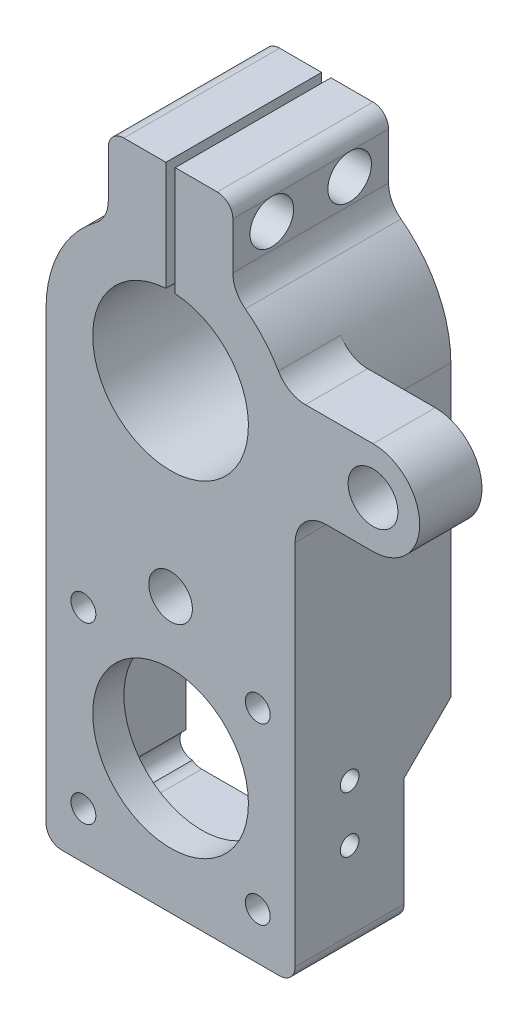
from build123d import *
from build123d.topology import SkipClean

# Parameters (mm, degrees)
SKETCH_1_R          = 25
SKETCH_1_R_2        = 8
SKETCH_1_R_3        = 4
SKETCH_1_R_4        = 7
EXTRUDE_1_DEPTH     = 20
FILLET_1_R          = 5
EXTRUDE_START       = 30
SKETCH_4_R          = 4
SKETCH_4_R_2        = 7
SKETCH_4_R_3        = 25
EXTRUDE_3_DEPTH     = 30
CUT_EXTRUDE_1_DEPTH = 40
CUT_EXTRUDE_2_DEPTH = 80
SKETCH_7_W          = 3
SKETCH_7_H          = 81.282537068
CUT_EXTRUDE_3_DEPTH = 41
SKETCH_8_R          = 7
CUT_EXTRUDE_4_DEPTH = 10
SKETCH_9_R          = 4.5
CUT_EXTRUDE_5_DEPTH = 182.727818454
SKETCH_10_R         = 3
CUT_EXTRUDE_6_DEPTH = 10
SKETCH_12_R         = 2.5
CUT_EXTRUDE_8_DEPTH = 15


with BuildPart() as part:
    # Sketch 1 → Extrude 1 (new body)
    with BuildSketch(Plane.XY):
        with BuildLine():
            Line((0, -43), (40, -43))
            Line((40, -43), (40, 80))
            ThreePointArc((40, 80), (42.928932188, 87.071067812), (50, 90))
            Line((50, 90), (65, 90))
            ThreePointArc((65, 90), (80, 105), (65, 120))
            Line((65, 120), (43.301270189, 120))
            ThreePointArc((43.301270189, 120), (38.301270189, 121.339745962), (34.641016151, 125))
            ThreePointArc((34.641016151, 125), (29.928117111, 131.53879813), (24, 137))
            ThreePointArc((24, 137), (21.05572809, 140.527864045), (20, 145))
            Line((20, 145), (20, 160))
            ThreePointArc((20, 160), (18.535533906, 163.535533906), (15, 165))
            Line((15, 165), (0, 165))
            Line((0, 165), (-15, 165))
            ThreePointArc((-15, 165), (-18.535533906, 163.535533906), (-20, 160))
            Line((-20, 160), (-20, 145))
            ThreePointArc((-20, 145), (-21.05572809, 140.527864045), (-24, 137))
            ThreePointArc((-24, 137), (-35.77708764, 122.88854382), (-40, 105))
            Line((-40, 105), (-40, -43))
            Line((-40, -43), (0, -43))
        make_face()
        Circle(SKETCH_1_R, mode=Mode.SUBTRACT)
        with Locations((0, 105)):
            Circle(SKETCH_1_R, mode=Mode.SUBTRACT)
        with Locations((65, 105)):
            Circle(SKETCH_1_R_2, mode=Mode.SUBTRACT)
        with Locations((28, 28)):
            Circle(SKETCH_1_R_3, mode=Mode.SUBTRACT)
        with Locations(Location((28, -28, 0), (0, 0, 180))):
            Circle(SKETCH_1_R_3, mode=Mode.SUBTRACT)
        with Locations((-28, -28)):
            Circle(SKETCH_1_R_3, mode=Mode.SUBTRACT)
        with Locations(Location((-28, 28, 0), (0, 0, 180))):
            Circle(SKETCH_1_R_3, mode=Mode.SUBTRACT)
        with Locations((0, 45)):
            Circle(SKETCH_1_R_4, mode=Mode.SUBTRACT)
    extrude(amount=EXTRUDE_1_DEPTH)

    # Fillet 1
    fillet_1_edges = [part.edges().sort_by_distance(p)[0] for p in [
        (-40, -43, 10),
        (40, -43, 10),
    ]]
    fillet(fillet_1_edges, radius=FILLET_1_R)

    # Sketch 4 → Extrude 3 (add)
    with SkipClean():  # the faces are left unmerged after this step: merging them gives an invalid solid
        with BuildSketch(Plane(origin=(0, 0, 0), x_dir=(-1, 0, 0), z_dir=(0, 0, -1)).offset(EXTRUDE_START)):
            with BuildLine():
                Line((-40, -38), (-40, 105))
                ThreePointArc((-40, 105), (-35.77708764, 122.88854382), (-24, 137))
                ThreePointArc((-24, 137), (-21.05572809, 140.527864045), (-20, 145))
                Line((-20, 145), (-20, 160))
                ThreePointArc((-20, 160), (-18.535533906, 163.535533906), (-15, 165))
                Line((-15, 165), (15, 165))
                ThreePointArc((15, 165), (18.535533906, 163.535533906), (20, 160))
                Line((20, 160), (20, 145))
                ThreePointArc((20, 145), (21.05572809, 140.527864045), (24, 137))
                ThreePointArc((24, 137), (35.77708764, 122.88854382), (40, 105))
                Line((40, 105), (40, -38))
                ThreePointArc((40, -38), (38.535533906, -41.535533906), (35, -43))
                Line((35, -43), (-35, -43))
                ThreePointArc((-35, -43), (-38.535533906, -41.535533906), (-40, -38))
            make_face()
            with Locations((28, -28)):
                Circle(SKETCH_4_R, mode=Mode.SUBTRACT)
            with Locations((-28, -28)):
                Circle(SKETCH_4_R, mode=Mode.SUBTRACT)
            with Locations((28, 28)):
                Circle(SKETCH_4_R, mode=Mode.SUBTRACT)
            with Locations((-28, 28)):
                Circle(SKETCH_4_R, mode=Mode.SUBTRACT)
            with Locations((0, 45)):
                Circle(SKETCH_4_R_2, mode=Mode.SUBTRACT)
            Circle(SKETCH_4_R_3, mode=Mode.SUBTRACT)
            with Locations((0, 105)):
                Circle(SKETCH_4_R_3, mode=Mode.SUBTRACT)
        extrude(amount=-EXTRUDE_3_DEPTH)

    # Sketch 5 → Cut-Extrude 1 (cut)
    with SkipClean():  # the faces are left unmerged after this step: merging them gives an invalid solid
        with BuildSketch(Plane(origin=(0, 0, -30), x_dir=(-1, 0, 0), z_dir=(0, 0, -1))):
            with BuildLine():
                Line((30, 59.17424305), (30, -28))
                ThreePointArc((30, -28), (28.535533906, -31.535533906), (25, -33))
                Line((25, -33), (-25, -33))
                ThreePointArc((-25, -33), (-28.535533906, -31.535533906), (-30, -28))
                Line((-30, -28), (-30, 59.17424305))
                ThreePointArc((-30, 59.17424305), (-25.477225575, 67.540843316), (-16, 68.33939444))
                ThreePointArc((-16, 68.33939444), (0, 65), (16, 68.33939444))
                ThreePointArc((16, 68.33939444), (25.477225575, 67.540843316), (30, 59.17424305))
            make_face()
        extrude(amount=-CUT_EXTRUDE_1_DEPTH, mode=Mode.SUBTRACT)

    # Sketch 6 → Cut-Extrude 2 (cut)
    with SkipClean():  # the faces are left unmerged after this step: merging them gives an invalid solid
        with BuildSketch(Plane(origin=(40, 0, 0), x_dir=(0, 0, -1), z_dir=(1, 0, 0))):
            Polygon((30, -43), (15, -43), (15, -3), (30, 12), align=None)
        extrude(amount=-CUT_EXTRUDE_2_DEPTH, mode=Mode.SUBTRACT)

    # Sketch 7 → Cut-Extrude 3 (cut)
    with SkipClean():  # the faces are left unmerged after this step: merging them gives an invalid solid
        with BuildSketch(Plane(origin=(0, 165, 0), x_dir=(1, 0, 0), z_dir=(0, 1, 0))):
            Rectangle(SKETCH_7_W, SKETCH_7_H)
        extrude(amount=-CUT_EXTRUDE_3_DEPTH, mode=Mode.SUBTRACT)

    # Sketch 8 → Cut-Extrude 4 (cut)
    with SkipClean():  # the faces are left unmerged after this step: merging them gives an invalid solid
        with BuildSketch(Plane(origin=(20, 0, 0), x_dir=(0, 0, -1), z_dir=(1, 0, 0))):
            with Locations(Location((-7.5, 153, 0), (0, 0, 90))):
                Circle(SKETCH_8_R)
            with Locations(Location((17.5, 153, 0), (0, 0, 90))):
                Circle(SKETCH_8_R)
        extrude(amount=-CUT_EXTRUDE_4_DEPTH, mode=Mode.SUBTRACT)

    # Sketch 9 → Cut-Extrude 5 (cut, through all)
    with SkipClean():  # the faces are left unmerged after this step: merging them gives an invalid solid
        with BuildSketch(Plane(origin=(10, 0, 0), x_dir=(0, 0, -1), z_dir=(1, 0, 0))):
            with Locations(Location((-7.5, 153, 0), (0, 0, 90))):
                Circle(SKETCH_9_R)
            with Locations(Location((17.5, 153, 0), (0, 0, 90))):
                Circle(SKETCH_9_R)
        extrude(amount=-CUT_EXTRUDE_5_DEPTH, mode=Mode.SUBTRACT)

    # Sketch 10 → Cut-Extrude 6 (cut)
    with SkipClean():  # the faces are left unmerged after this step: merging them gives an invalid solid
        with BuildSketch(Plane(origin=(40, 0, 0), x_dir=(0, 0, -1), z_dir=(1, 0, 0))):
            with Locations(Location((-2.5, -13, 0), (0, 0, 90))):
                Circle(SKETCH_10_R)
            with Locations(Location((-2.5, 5, 0), (0, 0, 90))):
                Circle(SKETCH_10_R)
            with Locations(Location((-2.5, 77, 0), (0, 0, 90))):
                Circle(SKETCH_10_R)
        extrude(amount=-CUT_EXTRUDE_6_DEPTH, mode=Mode.SUBTRACT)

    # Sketch 12 → Cut-Extrude 8 (cut)
    with SkipClean():  # the faces are left unmerged after this step: merging them gives an invalid solid
        with BuildSketch(Plane.ZY.offset(40)):
            with Locations(Location((0, 115, 0), (0, 0, 270))):
                Circle(SKETCH_12_R)
            with Locations(Location((0, 127, 0), (0, 0, 270))):
                Circle(SKETCH_12_R)
        extrude(amount=-CUT_EXTRUDE_8_DEPTH, mode=Mode.SUBTRACT)


solid = part.part
